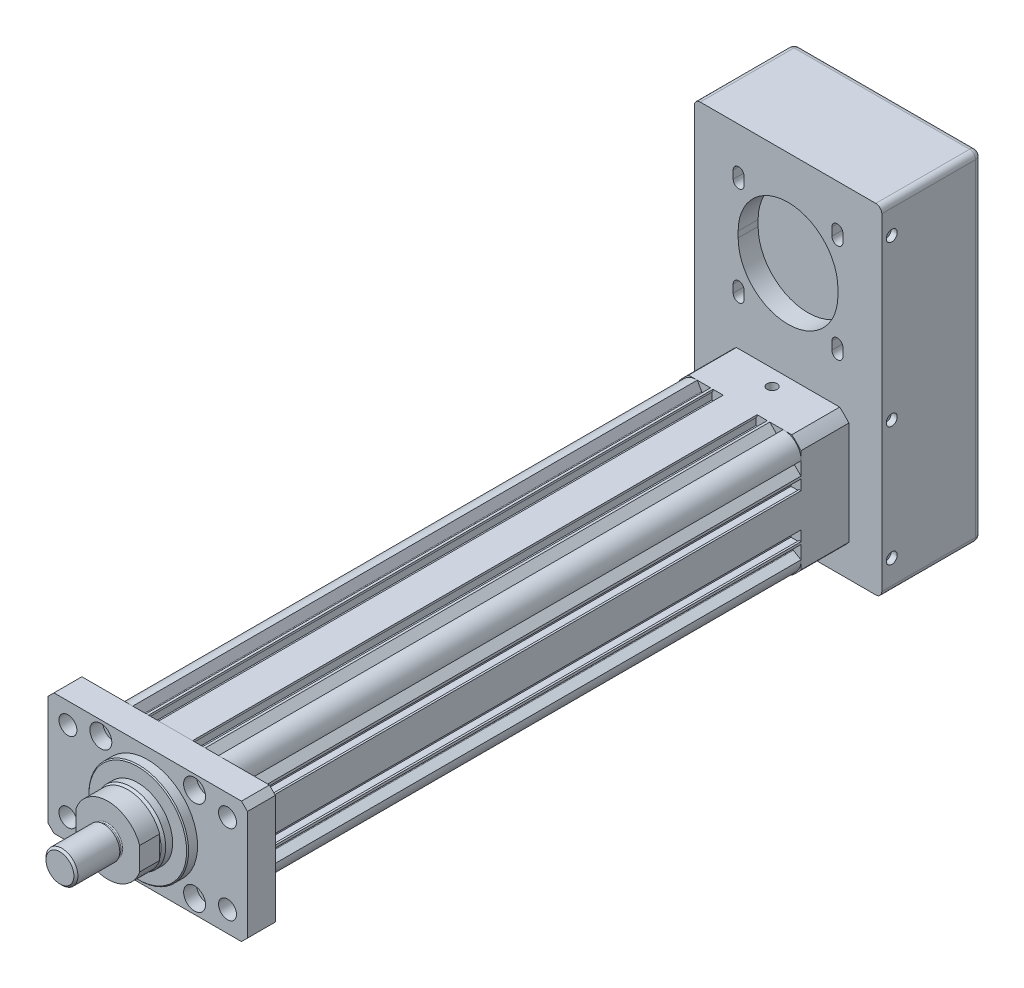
from build123d import *

# Parameters (mm, degrees)
SKETCH_1_R           = 25
SKETCH_1_R_2         = 2.594
EXTRUDE_1_DEPTH      = 283
EXTRUDE_1_2_DEPTH    = 14
SKETCH_3_R           = 4.5
SKETCH_3_R_2         = 3.5
CUT_EXTRUDE_3_DEPTH  = 14
SKETCH_3_5_R         = 5.5
CUT_EXTRUDE_4_DEPTH  = 6.5
SKETCH_5_R           = 25
EXTRUDE_2_DEPTH      = 5
CHAMFER_1_SIZE       = 0.5
SKETCH_6_R           = 17.5
EXTRUDE_3_DEPTH      = 5
CHAMFER_2_SIZE       = 1.5
CHAMFER_2_SIZE2      = 0.8
EXTRUDE_4_DEPTH      = 10
SKETCH_8_R           = 7
EXTRUDE_5_DEPTH      = 2
SKETCH_9_R           = 8
EXTRUDE_6_DEPTH      = 22
CHAMFER_3_SIZE       = 1
FILLET_1_R           = 0.5
SKETCH_10_W          = 61
SKETCH_10_H          = 61
EXTRUDE_7_DEPTH      = 24
SKETCH_11_R          = 50
SKETCH_11_R_2        = 40
CUT_EXTRUDE_1_DEPTH  = 24
SKETCH_26_W          = 94
SKETCH_26_H          = 170
EXTRUDE_11_DEPTH     = 50
FILLET_2_R           = 3
CUT_EXTRUDE_11_DEPTH = 10
CUT_EXTRUDE_12_DEPTH = 10
CUT_EXTRUDE_START    = -10
CUT_EXTRUDE_13_DEPTH = 5
SKETCH_28_R          = 2.75
CUT_EXTRUDE_14_DEPTH = 3
CUT_EXTRUDE_START_2  = -3
SKETCH_29_R          = 2.75
CUT_EXTRUDE_15_DEPTH = 3


with BuildPart() as part:
    # Sketch 1 → Extrude 1 (new body)
    with BuildSketch(Plane.XY):
        with BuildLine():
            Line((30.5, 8.5), (29.5, 8.5))
            Line((29.5, 8.5), (29.5, 7.9))
            Line((29.5, 7.9), (25.5, 7.9))
            Line((25.5, 7.9), (25.5, 14.2))
            Line((25.5, 14.2), (29.5, 14.2))
            Line((29.5, 14.2), (29.5, 13.6))
            Line((29.5, 13.6), (30.5, 13.6))
            Line((30.5, 13.6), (30.5, 14.843551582))
            Line((30.5, 14.843551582), (26.602512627, 18.741038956))
            ThreePointArc((26.602512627, 18.741038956), (26.502994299, 19.034210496), (26.675, 19.29163522))
            Line((26.675, 19.29163522), (30.5, 21.5))
            ThreePointArc((30.5, 21.5), (28.010599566, 28.010599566), (21.5, 30.5))
            Line((21.5, 30.5), (19.29163522, 26.675))
            ThreePointArc((19.29163522, 26.675), (19.034210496, 26.502994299), (18.741038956, 26.602512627))
            Line((18.741038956, 26.602512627), (14.843551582, 30.5))
            Line((14.843551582, 30.5), (13.6, 30.5))
            Line((13.6, 30.5), (13.6, 29.5))
            Line((13.6, 29.5), (14.2, 29.5))
            Line((14.2, 29.5), (14.2, 25.5))
            Line((14.2, 25.5), (7.9, 25.5))
            Line((7.9, 25.5), (7.9, 29.5))
            Line((7.9, 29.5), (8.5, 29.5))
            Line((8.5, 29.5), (8.5, 30.5))
            Line((8.5, 30.5), (-8.5, 30.5))
            Line((-8.5, 30.5), (-8.5, 29.5))
            Line((-8.5, 29.5), (-7.9, 29.5))
            Line((-7.9, 29.5), (-7.9, 25.5))
            Line((-7.9, 25.5), (-14.2, 25.5))
            Line((-14.2, 25.5), (-14.2, 29.5))
            Line((-14.2, 29.5), (-13.6, 29.5))
            Line((-13.6, 29.5), (-13.6, 30.5))
            Line((-13.6, 30.5), (-14.843551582, 30.5))
            Line((-14.843551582, 30.5), (-18.741038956, 26.602512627))
            ThreePointArc((-18.741038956, 26.602512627), (-19.034210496, 26.502994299), (-19.29163522, 26.675))
            Line((-19.29163522, 26.675), (-21.5, 30.5))
            ThreePointArc((-21.5, 30.5), (-28.010599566, 28.010599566), (-30.5, 21.5))
            Line((-30.5, 21.5), (-26.675, 19.29163522))
            ThreePointArc((-26.675, 19.29163522), (-26.502994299, 19.034210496), (-26.602512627, 18.741038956))
            Line((-26.602512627, 18.741038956), (-30.5, 14.843551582))
            Line((-30.5, 14.843551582), (-30.5, 13.6))
            Line((-30.5, 13.6), (-29.5, 13.6))
            Line((-29.5, 13.6), (-29.5, 14.2))
            Line((-29.5, 14.2), (-25.5, 14.2))
            Line((-25.5, 14.2), (-25.5, 7.9))
            Line((-25.5, 7.9), (-29.5, 7.9))
            Line((-29.5, 7.9), (-29.5, 8.5))
            Line((-29.5, 8.5), (-30.5, 8.5))
            Line((-30.5, 8.5), (-30.5, -8.5))
            Line((-30.5, -8.5), (-29.5, -8.5))
            Line((-29.5, -8.5), (-29.5, -7.9))
            Line((-29.5, -7.9), (-25.5, -7.9))
            Line((-25.5, -7.9), (-25.5, -14.2))
            Line((-25.5, -14.2), (-29.5, -14.2))
            Line((-29.5, -14.2), (-29.5, -13.6))
            Line((-29.5, -13.6), (-30.5, -13.6))
            Line((-30.5, -13.6), (-30.5, -14.843551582))
            Line((-30.5, -14.843551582), (-26.602512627, -18.741038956))
            ThreePointArc((-26.602512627, -18.741038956), (-26.502994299, -19.034210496), (-26.675, -19.29163522))
            Line((-26.675, -19.29163522), (-30.5, -21.5))
            ThreePointArc((-30.5, -21.5), (-27.825897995, -28.191225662), (-21, -30.5))
            Line((-21, -30.5), (-18.79163522, -26.675))
            ThreePointArc((-18.79163522, -26.675), (-18.534210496, -26.502994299), (-18.241038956, -26.602512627))
            Line((-18.241038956, -26.602512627), (-14.343551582, -30.5))
            Line((-14.343551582, -30.5), (14.343551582, -30.5))
            Line((14.343551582, -30.5), (18.241038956, -26.602512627))
            ThreePointArc((18.241038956, -26.602512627), (18.534210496, -26.502994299), (18.79163522, -26.675))
            Line((18.79163522, -26.675), (21, -30.5))
            ThreePointArc((21, -30.5), (27.825897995, -28.191225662), (30.5, -21.5))
            Line((30.5, -21.5), (26.675, -19.29163522))
            ThreePointArc((26.675, -19.29163522), (26.502994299, -19.034210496), (26.602512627, -18.741038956))
            Line((26.602512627, -18.741038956), (30.5, -14.843551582))
            Line((30.5, -14.843551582), (30.5, -13.6))
            Line((30.5, -13.6), (29.5, -13.6))
            Line((29.5, -13.6), (29.5, -14.2))
            Line((29.5, -14.2), (25.5, -14.2))
            Line((25.5, -14.2), (25.5, -7.9))
            Line((25.5, -7.9), (29.5, -7.9))
            Line((29.5, -7.9), (29.5, -8.5))
            Line((29.5, -8.5), (30.5, -8.5))
            Line((30.5, -8.5), (30.5, 8.5))
        make_face()
        Circle(SKETCH_1_R, mode=Mode.SUBTRACT)
        with Locations((23.5, -23.5)):
            Circle(SKETCH_1_R_2, mode=Mode.SUBTRACT)
        with Locations((-23.5, -23.5)):
            Circle(SKETCH_1_R_2, mode=Mode.SUBTRACT)
        with Locations((23.5, 23.5)):
            Circle(SKETCH_1_R_2, mode=Mode.SUBTRACT)
        with Locations((-23.5, 23.5)):
            Circle(SKETCH_1_R_2, mode=Mode.SUBTRACT)
        with BuildLine():
            Line((-14.843484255, -26.551505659), (-5.699422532, -26.551505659))
            ThreePointArc((-5.699422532, -26.551505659), (-5.401016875, -26.282393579), (-5.637974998, -25.957866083))
            ThreePointArc((-5.637974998, -25.957866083), (-10.496775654, -24.470016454), (-15.006657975, -22.128520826))
            ThreePointArc((-15.006657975, -22.128520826), (-15.31244973, -22.117932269), (-15.468484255, -22.381131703))
            Line((-15.468484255, -22.381131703), (-15.468484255, -25.926505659))
            Line((-15.468484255, -25.926505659), (-14.843484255, -26.551505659))
        make_face(mode=Mode.SUBTRACT)
        with BuildLine():
            Line((15.037740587, -26.551505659), (5.893678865, -26.551505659))
            ThreePointArc((5.893678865, -26.551505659), (5.595273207, -26.282393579), (5.832231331, -25.957866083))
            ThreePointArc((5.832231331, -25.957866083), (10.691031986, -24.470016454), (15.200914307, -22.128520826))
            ThreePointArc((15.200914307, -22.128520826), (15.506706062, -22.117932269), (15.662740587, -22.381131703))
            Line((15.662740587, -22.381131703), (15.662740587, -25.926505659))
            Line((15.662740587, -25.926505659), (15.037740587, -26.551505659))
        make_face(mode=Mode.SUBTRACT)
        with BuildLine():
            Line((24.057261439, -13.884764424), (23.358946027, -13.481591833))
            ThreePointArc((23.358946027, -13.481591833), (23.055418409, -13.441631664), (22.812535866, -13.628001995))
            Line((22.812535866, -13.628001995), (21.480305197, -15.935493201))
            ThreePointArc((21.480305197, -15.935493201), (21.440345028, -16.239020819), (21.626715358, -16.481903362))
            Line((21.626715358, -16.481903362), (22.892186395, -17.212523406))
            ThreePointArc((22.892186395, -17.212523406), (23.195714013, -17.252483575), (23.438596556, -17.066113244))
            Line((23.438596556, -17.066113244), (24.274264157, -15.618694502))
            ThreePointArc((24.274264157, -15.618694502), (24.317966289, -15.507082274), (24.326638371, -15.387533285))
            Line((24.326638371, -15.387533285), (24.223757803, -14.070923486))
            ThreePointArc((24.223757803, -14.070923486), (24.155411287, -13.964516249), (24.057261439, -13.884764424))
        make_face(mode=Mode.SUBTRACT)
        with BuildLine():
            Line((-24.057261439, -13.884764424), (-23.358946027, -13.481591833))
            ThreePointArc((-23.358946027, -13.481591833), (-23.055418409, -13.441631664), (-22.812535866, -13.628001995))
            Line((-22.812535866, -13.628001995), (-21.480305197, -15.935493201))
            ThreePointArc((-21.480305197, -15.935493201), (-21.440345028, -16.239020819), (-21.626715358, -16.481903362))
            Line((-21.626715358, -16.481903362), (-22.892186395, -17.212523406))
            ThreePointArc((-22.892186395, -17.212523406), (-23.195714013, -17.252483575), (-23.438596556, -17.066113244))
            Line((-23.438596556, -17.066113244), (-24.274264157, -15.618694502))
            ThreePointArc((-24.274264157, -15.618694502), (-24.317966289, -15.507082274), (-24.326638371, -15.387533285))
            Line((-24.326638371, -15.387533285), (-24.223757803, -14.070923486))
            ThreePointArc((-24.223757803, -14.070923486), (-24.155411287, -13.964516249), (-24.057261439, -13.884764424))
        make_face(mode=Mode.SUBTRACT)
        with BuildLine():
            Line((24.057261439, 13.884764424), (23.358946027, 13.481591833))
            ThreePointArc((23.358946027, 13.481591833), (23.055418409, 13.441631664), (22.812535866, 13.628001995))
            Line((22.812535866, 13.628001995), (21.480305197, 15.935493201))
            ThreePointArc((21.480305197, 15.935493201), (21.440345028, 16.239020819), (21.626715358, 16.481903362))
            Line((21.626715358, 16.481903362), (22.892186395, 17.212523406))
            ThreePointArc((22.892186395, 17.212523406), (23.195714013, 17.252483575), (23.438596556, 17.066113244))
            Line((23.438596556, 17.066113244), (24.274264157, 15.618694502))
            ThreePointArc((24.274264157, 15.618694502), (24.317966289, 15.507082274), (24.326638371, 15.387533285))
            Line((24.326638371, 15.387533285), (24.223757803, 14.070923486))
            ThreePointArc((24.223757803, 14.070923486), (24.155411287, 13.964516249), (24.057261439, 13.884764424))
        make_face(mode=Mode.SUBTRACT)
        with BuildLine():
            Line((-24.057261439, 13.884764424), (-23.358946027, 13.481591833))
            ThreePointArc((-23.358946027, 13.481591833), (-23.055418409, 13.441631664), (-22.812535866, 13.628001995))
            Line((-22.812535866, 13.628001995), (-21.480305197, 15.935493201))
            ThreePointArc((-21.480305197, 15.935493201), (-21.440345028, 16.239020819), (-21.626715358, 16.481903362))
            Line((-21.626715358, 16.481903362), (-22.892186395, 17.212523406))
            ThreePointArc((-22.892186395, 17.212523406), (-23.195714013, 17.252483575), (-23.438596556, 17.066113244))
            Line((-23.438596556, 17.066113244), (-24.274264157, 15.618694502))
            ThreePointArc((-24.274264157, 15.618694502), (-24.317966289, 15.507082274), (-24.326638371, 15.387533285))
            Line((-24.326638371, 15.387533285), (-24.223757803, 14.070923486))
            ThreePointArc((-24.223757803, 14.070923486), (-24.155411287, 13.964516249), (-24.057261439, 13.884764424))
        make_face(mode=Mode.SUBTRACT)
        with BuildLine():
            Line((17.761634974, 23.75411276), (17.07315308, 24.68624059))
            ThreePointArc((17.07315308, 24.68624059), (16.934629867, 24.812286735), (16.758415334, 24.87572765))
            Line((16.758415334, 24.87572765), (13.966108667, 25.295529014))
            ThreePointArc((13.966108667, 25.295529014), (13.689318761, 25.25468305), (13.482325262, 25.066441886))
            Line((13.482325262, 25.066441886), (12.839111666, 23.986237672))
            ThreePointArc((12.839111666, 23.986237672), (12.785382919, 23.626185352), (12.999780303, 23.331977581))
            ThreePointArc((12.999780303, 23.331977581), (14.833000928, 22.112125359), (16.576342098, 20.766949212))
            ThreePointArc((16.576342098, 20.766949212), (17.053890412, 20.688035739), (17.357364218, 21.065107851))
            Line((17.357364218, 21.065107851), (17.761634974, 23.75411276))
        make_face(mode=Mode.SUBTRACT)
        with BuildLine():
            Line((-17.761634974, 23.75411276), (-17.07315308, 24.68624059))
            ThreePointArc((-17.07315308, 24.68624059), (-16.934629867, 24.812286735), (-16.758415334, 24.87572765))
            Line((-16.758415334, 24.87572765), (-13.966108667, 25.295529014))
            ThreePointArc((-13.966108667, 25.295529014), (-13.689318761, 25.25468305), (-13.482325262, 25.066441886))
            Line((-13.482325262, 25.066441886), (-12.839111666, 23.986237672))
            ThreePointArc((-12.839111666, 23.986237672), (-12.785382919, 23.626185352), (-12.999780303, 23.331977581))
            ThreePointArc((-12.999780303, 23.331977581), (-14.833000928, 22.112125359), (-16.576342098, 20.766949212))
            ThreePointArc((-16.576342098, 20.766949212), (-17.053890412, 20.688035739), (-17.357364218, 21.065107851))
            Line((-17.357364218, 21.065107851), (-17.761634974, 23.75411276))
        make_face(mode=Mode.SUBTRACT)
    extrude(amount=EXTRUDE_1_DEPTH)

    # Sketch 10 → Extrude 7 (add)
    with BuildSketch(Plane(origin=(0, 0, 0), x_dir=(-1, 0, 0), z_dir=(0, 0, -1))):
        Rectangle(SKETCH_10_W, SKETCH_10_H)
    extrude(amount=EXTRUDE_7_DEPTH)

    # Sketch 11 → Cut-Extrude 1 (cut)
    with BuildSketch(Plane(origin=(0, 0, -24), x_dir=(-1, 0, 0), z_dir=(0, 0, -1))):
        Circle(SKETCH_11_R)
        Circle(SKETCH_11_R_2, mode=Mode.SUBTRACT)
    extrude(amount=-CUT_EXTRUDE_1_DEPTH, mode=Mode.SUBTRACT)

    # Sketch 15 → Hole Wizard M6 _1 (revolve, cut)
    with BuildSketch(Plane(origin=(0, 30.5, -16), x_dir=(0, 0, 1), z_dir=(1, 0, 0))):
        Polygon((0, 0), (0, 9.502151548), (2.5, 8), (2.5, 0), align=None)
    revolve(axis=Axis((0, 36.85, -16), (0, -1, 0)), mode=Mode.SUBTRACT)

    # Sketch 26 → Extrude 11 (add)
    with BuildSketch(Plane(origin=(0, 0, -24), x_dir=(-1, 0, 0), z_dir=(0, 0, -1))):
        with Locations((0, 43)):
            Rectangle(SKETCH_26_W, SKETCH_26_H)
    extrude(amount=EXTRUDE_11_DEPTH)

    # Fillet 2
    fillet_2_edges = [part.edges().sort_by_distance(p)[0] for p in [
        (-47, -42, -49),
        (-47, 128, -49),
        (47, 128, -49),
        (47, -42, -49),
        (-47, 43, -74),
        (0, 128, -74),
        (47, 43, -74),
        (0, -42, -74),
    ]]
    fillet(fillet_2_edges, radius=FILLET_2_R)

    # Sketch 27 → Cut-Extrude 11 (cut)
    with BuildSketch(Plane.XY.offset(-24)):
        with BuildLine():
            Line((-25, 81.5), (-25, 78.5))
            ThreePointArc((-25, 78.5), (0, 53.5), (25, 78.5))
            Line((25, 78.5), (25, 81.5))
            ThreePointArc((25, 81.5), (0, 106.5), (-25, 81.5))
        make_face()
    extrude(amount=-CUT_EXTRUDE_11_DEPTH, mode=Mode.SUBTRACT)

    # Sketch 27_3 → Cut-Extrude 12 (cut)
    with BuildSketch(Plane.XY.offset(-24)):
        with BuildLine():
            Line((-27.498737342, 102.748737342), (-27.498737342, 106.748737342))
            ThreePointArc((-27.498737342, 106.748737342), (-24.748737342, 109.498737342), (-21.998737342, 106.748737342))
            Line((-21.998737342, 106.748737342), (-21.998737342, 102.748737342))
            ThreePointArc((-21.998737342, 102.748737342), (-24.748737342, 99.998737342), (-27.498737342, 102.748737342))
        make_face()
        with BuildLine():
            Line((27.498737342, 102.748737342), (27.498737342, 106.748737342))
            ThreePointArc((27.498737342, 106.748737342), (24.748737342, 109.498737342), (21.998737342, 106.748737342))
            Line((21.998737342, 106.748737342), (21.998737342, 102.748737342))
            ThreePointArc((21.998737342, 102.748737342), (24.748737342, 99.998737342), (27.498737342, 102.748737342))
        make_face()
        with BuildLine():
            Line((27.498737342, 57.251262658), (27.498737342, 53.251262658))
            ThreePointArc((27.498737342, 53.251262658), (24.748737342, 50.501262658), (21.998737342, 53.251262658))
            Line((21.998737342, 53.251262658), (21.998737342, 57.251262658))
            ThreePointArc((21.998737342, 57.251262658), (24.748737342, 60.001262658), (27.498737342, 57.251262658))
        make_face()
        with BuildLine():
            Line((-27.498737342, 57.251262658), (-27.498737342, 53.251262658))
            ThreePointArc((-27.498737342, 53.251262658), (-24.748737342, 50.501262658), (-21.998737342, 53.251262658))
            Line((-21.998737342, 53.251262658), (-21.998737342, 57.251262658))
            ThreePointArc((-21.998737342, 57.251262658), (-24.748737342, 60.001262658), (-27.498737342, 57.251262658))
        make_face()
    extrude(amount=-CUT_EXTRUDE_12_DEPTH, mode=Mode.SUBTRACT)

    # Sketch 27_4 → Cut-Extrude 13 (cut)
    with BuildSketch(Plane.XY.offset(-24).offset(CUT_EXTRUDE_START)):
        with BuildLine():
            Line((-28.848737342, 101.848737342), (-28.848737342, 107.648737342))
            ThreePointArc((-28.848737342, 107.648737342), (-24.748737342, 111.748737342), (-20.648737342, 107.648737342))
            Line((-20.648737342, 107.648737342), (-20.648737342, 101.848737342))
            ThreePointArc((-20.648737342, 101.848737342), (-24.748737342, 97.748737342), (-28.848737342, 101.848737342))
        make_face()
        with BuildLine():
            Line((28.848737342, 101.848737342), (28.848737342, 107.648737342))
            ThreePointArc((28.848737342, 107.648737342), (24.748737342, 111.748737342), (20.648737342, 107.648737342))
            Line((20.648737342, 107.648737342), (20.648737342, 101.848737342))
            ThreePointArc((20.648737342, 101.848737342), (24.748737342, 97.748737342), (28.848737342, 101.848737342))
        make_face()
        with BuildLine():
            Line((28.848737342, 58.151262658), (28.848737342, 52.351262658))
            ThreePointArc((28.848737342, 52.351262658), (24.748737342, 48.251262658), (20.648737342, 52.351262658))
            Line((20.648737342, 52.351262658), (20.648737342, 58.151262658))
            ThreePointArc((20.648737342, 58.151262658), (24.748737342, 62.251262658), (28.848737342, 58.151262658))
        make_face()
        with BuildLine():
            Line((-28.848737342, 58.151262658), (-28.848737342, 52.351262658))
            ThreePointArc((-28.848737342, 52.351262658), (-24.748737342, 48.251262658), (-20.648737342, 52.351262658))
            Line((-20.648737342, 52.351262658), (-20.648737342, 58.151262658))
            ThreePointArc((-20.648737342, 58.151262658), (-24.748737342, 62.251262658), (-28.848737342, 58.151262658))
        make_face()
    extrude(amount=-CUT_EXTRUDE_13_DEPTH, mode=Mode.SUBTRACT)

    # Sketch 28 → Cut-Extrude 14 (cut)
    with BuildSketch(Plane.ZY.offset(47)):
        with Locations((-29, -27)):
            Circle(SKETCH_28_R)
        with Locations((-29, 33)):
            Circle(SKETCH_28_R)
        with Locations((-29, 113)):
            Circle(SKETCH_28_R)
    extrude(amount=-CUT_EXTRUDE_14_DEPTH, mode=Mode.SUBTRACT)

    # Sketch 29 → Cut-Extrude 15 (cut)
    with BuildSketch(Plane(origin=(47, 0, 0), x_dir=(0, 0, -1), z_dir=(1, 0, 0)).offset(CUT_EXTRUDE_START_2)):
        with Locations(Location((29, -27, 0), (0, 0, 180))):
            Circle(SKETCH_29_R)
        with Locations(Location((29, 33, 0), (0, 0, 180))):
            Circle(SKETCH_29_R)
        with Locations(Location((29, 113, 0), (0, 0, 180))):
            Circle(SKETCH_29_R)
    extrude(amount=CUT_EXTRUDE_15_DEPTH, mode=Mode.SUBTRACT)


with BuildPart() as body_2:
    # Sketch 2 → Extrude 1 2 (new body)
    with BuildSketch(Plane.XY.offset(283)):
        Polygon((-47, 30.5), (-50, 27.5), (-50, -27.5), (-47, -30.5), (47, -30.5), (50, -27.5), (50, 27.5), (47, 30.5), align=None)
    extrude(amount=EXTRUDE_1_2_DEPTH)

    # Sketch 3 → Cut-Extrude 3 (cut)
    with BuildSketch(Plane.XY.offset(297)):
        with Locations((-40, -20)):
            Circle(SKETCH_3_R)
        with Locations((-23.5, -23.5)):
            Circle(SKETCH_3_R_2)
        with Locations((-23.5, 23.5)):
            Circle(SKETCH_3_R_2)
        with Locations((23.5, 23.5)):
            Circle(SKETCH_3_R_2)
        with Locations((40, 20)):
            Circle(SKETCH_3_R)
        with Locations((40, -20)):
            Circle(SKETCH_3_R)
        with Locations((23.5, -23.5)):
            Circle(SKETCH_3_R_2)
        with Locations((-40, 20)):
            Circle(SKETCH_3_R)
    extrude(amount=-CUT_EXTRUDE_3_DEPTH, mode=Mode.SUBTRACT)

    # Sketch 3_5 → Cut-Extrude 4 (cut)
    with BuildSketch(Plane.XY.offset(297)):
        with Locations((-23.5, 23.5)):
            Circle(SKETCH_3_5_R)
        with Locations((-23.5, -23.5)):
            Circle(SKETCH_3_5_R)
        with Locations((23.5, -23.5)):
            Circle(SKETCH_3_5_R)
        with Locations((23.5, 23.5)):
            Circle(SKETCH_3_5_R)
    extrude(amount=-CUT_EXTRUDE_4_DEPTH, mode=Mode.SUBTRACT)

    # Sketch 5 → Extrude 2 (add)
    with BuildSketch(Plane.XY.offset(297)):
        Circle(SKETCH_5_R)
    extrude(amount=EXTRUDE_2_DEPTH)

    # Chamfer 1
    chamfer_1_edges = [body_2.edges().sort_by_distance(p)[0] for p in [
        (-25, 0, 302),
    ]]
    chamfer(chamfer_1_edges, length=CHAMFER_1_SIZE)

    # Sketch 6 → Extrude 3 (add)
    with BuildSketch(Plane.XY.offset(302)):
        Circle(SKETCH_6_R)
    extrude(amount=EXTRUDE_3_DEPTH)

    # Chamfer 2
    chamfer_2_edges = [body_2.edges().sort_by_distance(p)[0] for p in [
        (-17.5, 0, 307),
    ]]
    chamfer_2_side = [body_2.faces().sort_by_distance(p)[0] for p in [
        (-17.5, 0, 304.5),
    ]]
    chamfer(chamfer_2_edges, length=CHAMFER_2_SIZE, length2=CHAMFER_2_SIZE2, reference=chamfer_2_side[0])

    # Sketch 7 → Extrude 4 (add)
    with BuildSketch(Plane.XY.offset(307)):
        with BuildLine():
            Line((-16, 5.744562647), (-16, -5.744562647))
            ThreePointArc((-16, -5.744562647), (0, -17), (16, -5.744562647))
            Line((16, -5.744562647), (16, 5.744562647))
            ThreePointArc((16, 5.744562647), (0, 17), (-16, 5.744562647))
        make_face()
    extrude(amount=EXTRUDE_4_DEPTH)

    # Sketch 8 → Extrude 5 (add)
    with BuildSketch(Plane.XY.offset(317)):
        Circle(SKETCH_8_R)
    extrude(amount=EXTRUDE_5_DEPTH)

    # Sketch 9 → Extrude 6 (add)
    with BuildSketch(Plane.XY.offset(319)):
        Circle(SKETCH_9_R)
    extrude(amount=EXTRUDE_6_DEPTH)

    # Chamfer 3
    chamfer_3_edges = [body_2.edges().sort_by_distance(p)[0] for p in [
        (-8, 0, 341),
    ]]
    chamfer(chamfer_3_edges, length=CHAMFER_3_SIZE)

    # Fillet 1
    fillet_1_edges = [body_2.edges().sort_by_distance(p)[0] for p in [
        (-7, 0, 317),
    ]]
    fillet(fillet_1_edges, radius=FILLET_1_R)


solid = Compound([part.part, body_2.part])
